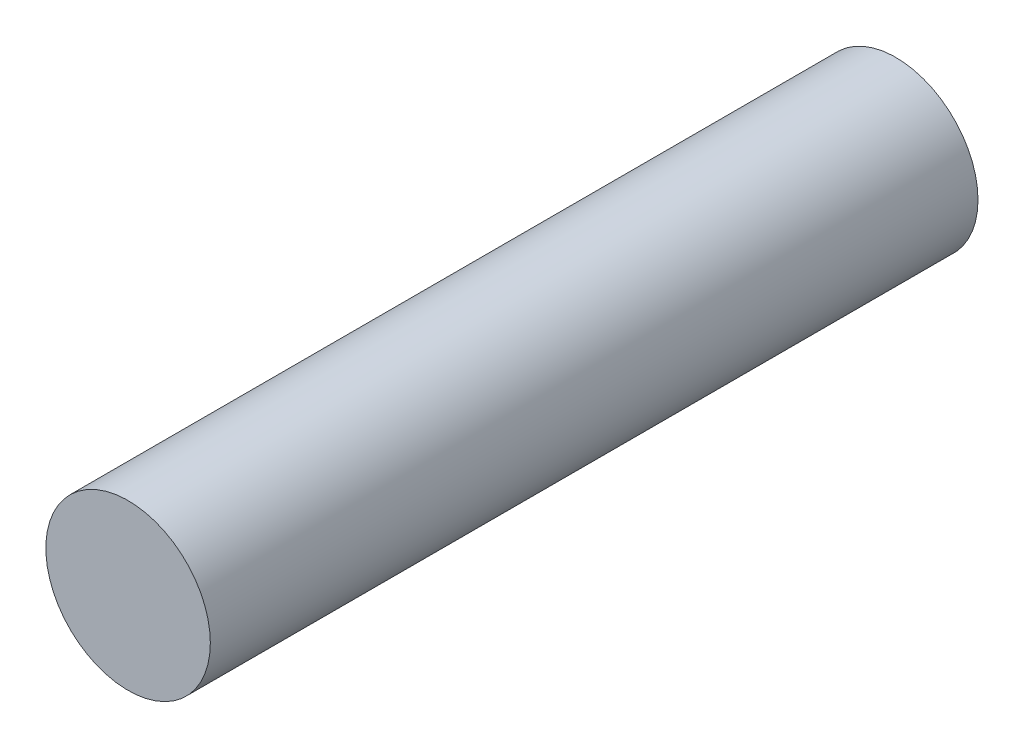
from build123d import *

# Parameters (mm, degrees)
SKETCH1_R           = 1.5
BOSS_EXTRUDE1_DEPTH = 7


with BuildPart() as part:
    # Sketch1 → Boss-Extrude1 (new, symmetric)
    with BuildSketch(Plane.XY):
        Circle(SKETCH1_R)
    extrude(amount=BOSS_EXTRUDE1_DEPTH, both=True)


solid = part.part
